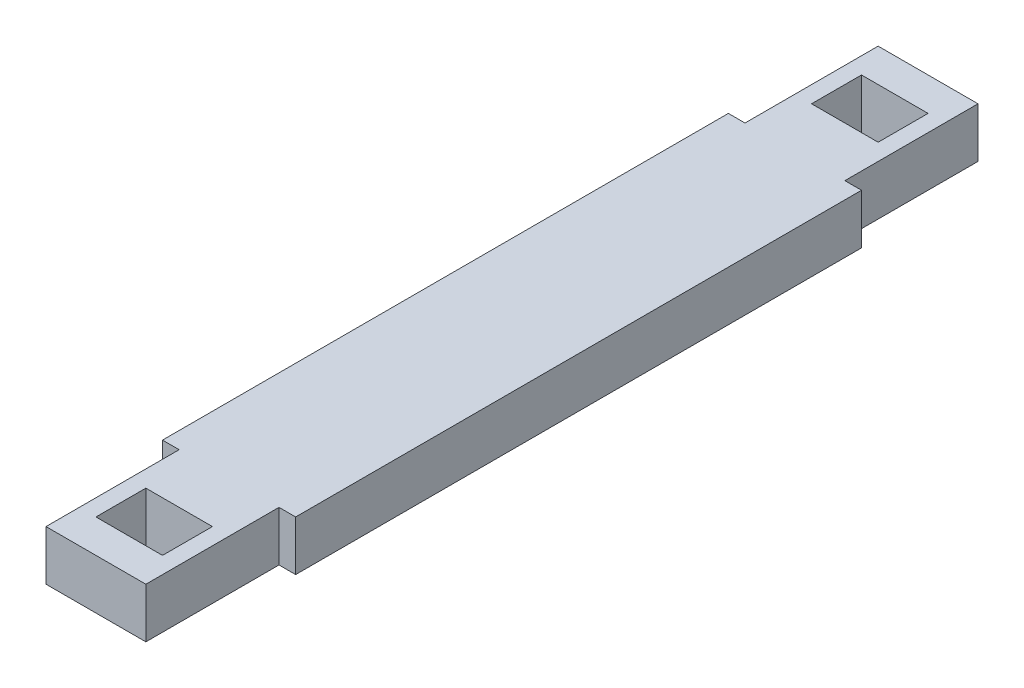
from build123d import *

# Parameters (mm, degrees)
SKETCH1_W           = 30
SKETCH1_H           = 15
BOSS_EXTRUDE1_DEPTH = 250
SKETCH2_W           = 20
SKETCH2_H           = 15
CUT_EXTRUDE1_DEPTH  = 15
SKETCH4_W           = 40
SKETCH4_H           = 170
BOSS_EXTRUDE3_DEPTH = 15


with BuildPart() as part:
    # Sketch1 → Boss-Extrude1 (new body)
    with BuildSketch(Plane.XY):
        Rectangle(SKETCH1_W, SKETCH1_H)
    extrude(amount=BOSS_EXTRUDE1_DEPTH)

    # Sketch2 → Cut-Extrude1 (cut)
    with BuildSketch(Plane(origin=(0, 7.5, 0), x_dir=(1, 0, 0), z_dir=(0, 1, 0))):
        with Locations((0, -17.5)):
            Rectangle(SKETCH2_W, SKETCH2_H)
        with Locations((0, -232.5)):
            Rectangle(SKETCH2_W, SKETCH2_H)
    extrude(amount=-CUT_EXTRUDE1_DEPTH, mode=Mode.SUBTRACT)

    # Sketch4 → Boss-Extrude3 (add)
    with BuildSketch(Plane(origin=(0, 7.5, 0), x_dir=(1, 0, 0), z_dir=(0, 1, 0))):
        with Locations((0, -125)):
            Rectangle(SKETCH4_W, SKETCH4_H)
    extrude(amount=-BOSS_EXTRUDE3_DEPTH)


solid = part.part
